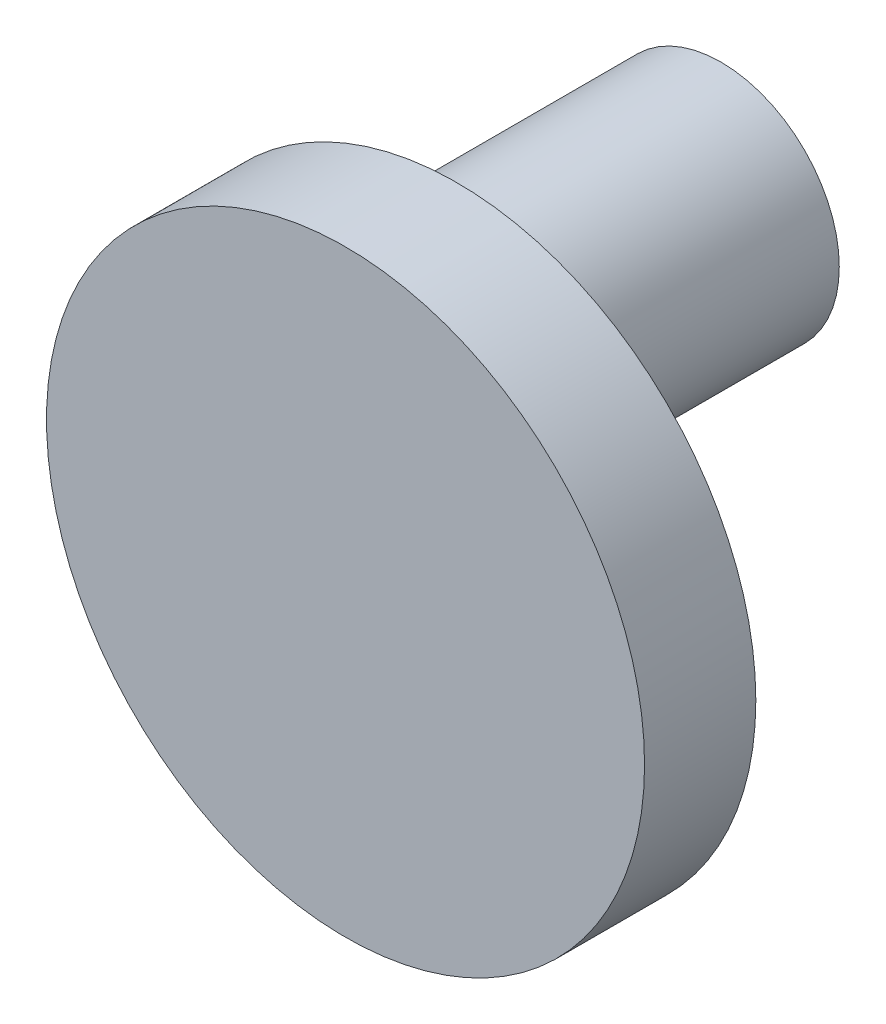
from build123d import *

# Parameters (mm, degrees)
ESQUISSE1_R          = 21.5
BASE_EXTRUSION_DEPTH = 8
ESQUISSE2_R          = 8.5
BOSS_EXTRU_1_DEPTH   = 30


with BuildPart() as part:
    # Esquisse1 → Base-Extrusion (new body)
    with BuildSketch(Plane.XY):
        Circle(ESQUISSE1_R)
    extrude(amount=-BASE_EXTRUSION_DEPTH)

    # Esquisse2 → Boss.-Extru.1 (add)
    with BuildSketch(Plane(origin=(0, 0, -8), x_dir=(-1, 0, 0), z_dir=(0, 0, -1))):
        with Locations(Location((11, 0, 0), (0, 0, 180))):
            Circle(ESQUISSE2_R)
    extrude(amount=BOSS_EXTRU_1_DEPTH)


solid = part.part
